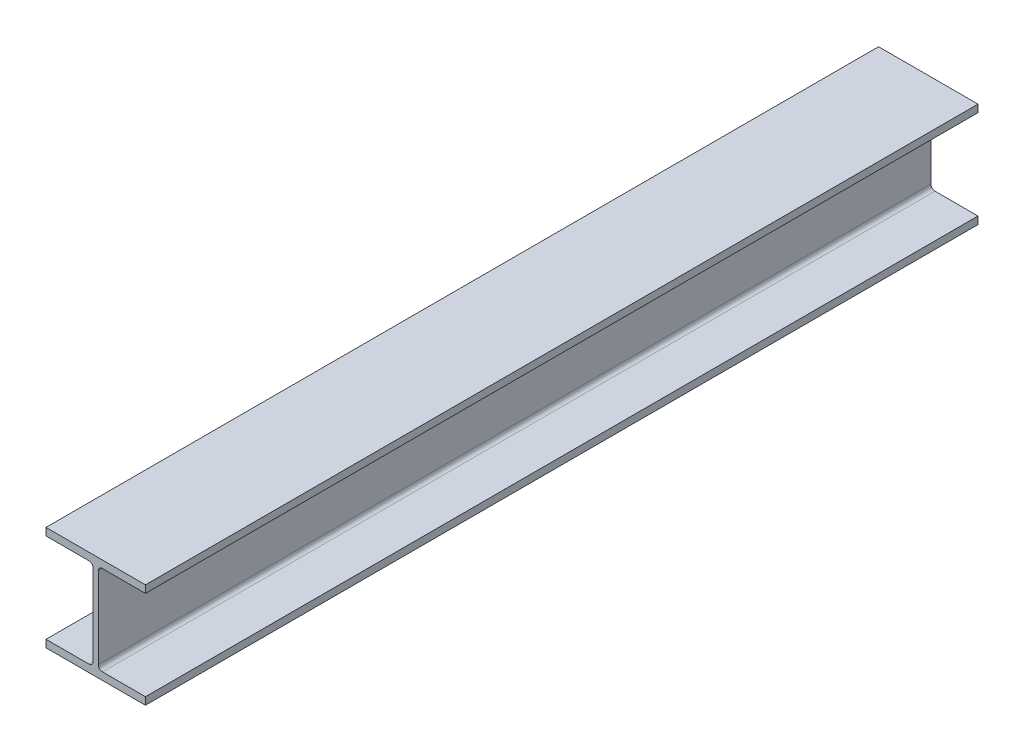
from build123d import *

# Parameters (mm, degrees)
BASESTEELW_DEPTH = 646.51128


with BuildPart() as part:
    # Sketch1 → BaseSteelW (new, symmetric)
    with BuildSketch(Plane.XY):
        with BuildLine():
            Line((0, 0), (0, 11.557))
            Line((0, 11.557), (66.802, 11.557))
            ThreePointArc((66.802, 11.557), (71.292128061, 13.416871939), (73.152, 17.907))
            Line((73.152, 17.907), (73.152, 144.145))
            ThreePointArc((73.152, 144.145), (71.292128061, 148.635128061), (66.802, 150.495))
            Line((66.802, 150.495), (0, 150.495))
            Line((0, 150.495), (0, 162.052))
            Line((0, 162.052), (154.432, 162.052))
            Line((154.432, 162.052), (154.432, 150.495))
            Line((154.432, 150.495), (87.63, 150.495))
            ThreePointArc((87.63, 150.495), (83.139871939, 148.635128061), (81.28, 144.145))
            Line((81.28, 144.145), (81.28, 17.907))
            ThreePointArc((81.28, 17.907), (83.139871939, 13.416871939), (87.63, 11.557))
            Line((87.63, 11.557), (154.432, 11.557))
            Line((154.432, 11.557), (154.432, 0))
            Line((154.432, 0), (0, 0))
        make_face()
    extrude(amount=BASESTEELW_DEPTH, both=True)


solid = part.part
